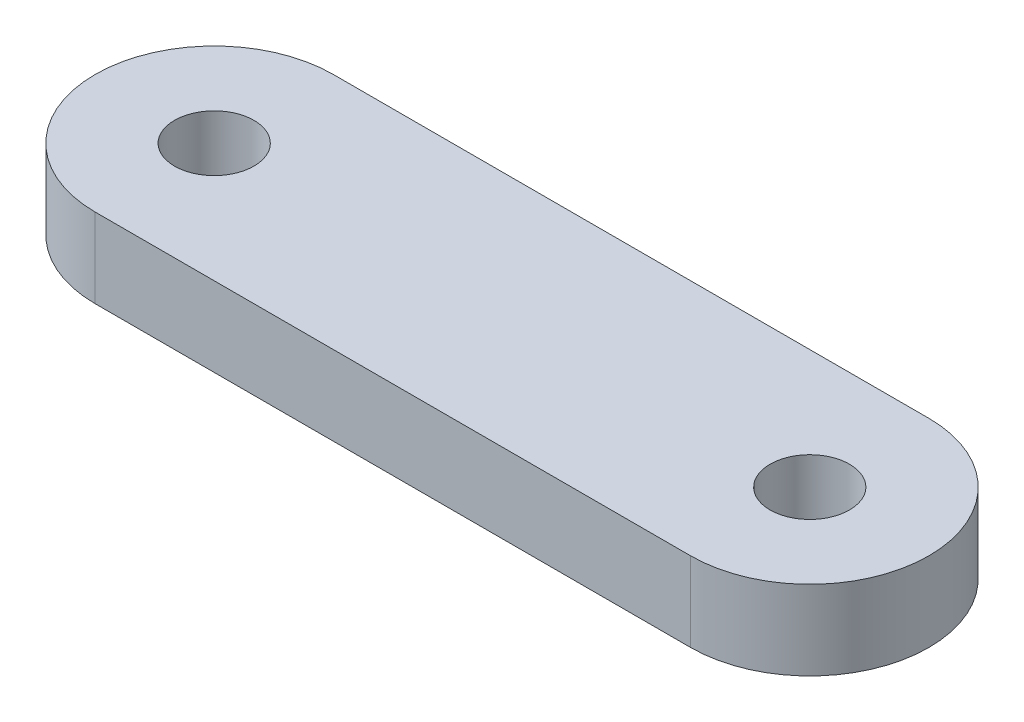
ISO-10303-21;
HEADER;
FILE_DESCRIPTION(('STEP AP214'),'2;1');
FILE_NAME('part.step','',(''),(''),'','','');
FILE_SCHEMA(('AUTOMOTIVE_DESIGN { 1 0 10303 214 1 1 1 1 }'));
ENDSEC;
DATA;
#1=APPLICATION_CONTEXT('core data for automotive mechanical design processes');
#2=APPLICATION_PROTOCOL_DEFINITION('international standard','automotive_design',2000,#1);
#3=PRODUCT_CONTEXT('',#1,'mechanical');
#4=PRODUCT('Part','Part','',(#3));
#5=PRODUCT_RELATED_PRODUCT_CATEGORY('part','',(#4));
#6=PRODUCT_DEFINITION_FORMATION('','',#4);
#7=PRODUCT_DEFINITION_CONTEXT('part definition',#1,'design');
#8=PRODUCT_DEFINITION('design','',#6,#7);
#9=PRODUCT_DEFINITION_SHAPE('','',#8);
#10=(LENGTH_UNIT() NAMED_UNIT(*) SI_UNIT(.MILLI.,.METRE.));
#11=(NAMED_UNIT(*) PLANE_ANGLE_UNIT() SI_UNIT($,.RADIAN.));
#12=(NAMED_UNIT(*) SI_UNIT($,.STERADIAN.) SOLID_ANGLE_UNIT());
#13=UNCERTAINTY_MEASURE_WITH_UNIT(LENGTH_MEASURE(1.E-05),#10,'distance_accuracy_value','');
#14=(GEOMETRIC_REPRESENTATION_CONTEXT(3) GLOBAL_UNCERTAINTY_ASSIGNED_CONTEXT((#13)) GLOBAL_UNIT_ASSIGNED_CONTEXT((#10,
#11,#12)) REPRESENTATION_CONTEXT('',''));
#15=CARTESIAN_POINT('',(0.,0.,0.));
#16=DIRECTION('',(0.,0.,1.));
#17=DIRECTION('',(1.,0.,0.));
#18=AXIS2_PLACEMENT_3D('',#15,#16,#17);
#19=CARTESIAN_POINT('',(-7.5,2.,0.));
#20=DIRECTION('',(0.,-1.,0.));
#21=DIRECTION('',(0.,0.,-1.));
#22=AXIS2_PLACEMENT_3D('',#19,#20,#21);
#23=PLANE('',#22);
#24=CARTESIAN_POINT('',(-7.5,2.,0.));
#25=DIRECTION('',(0.,1.,0.));
#26=DIRECTION('',(0.,0.,1.));
#27=AXIS2_PLACEMENT_3D('',#24,#25,#26);
#28=CIRCLE('',#27,1.);
#29=CARTESIAN_POINT('',(-7.5,2.,1.));
#30=VERTEX_POINT('',#29);
#31=EDGE_CURVE('E82',#30,#30,#28,.T.);
#32=ORIENTED_EDGE('',*,*,#31,.F.);
#33=EDGE_LOOP('',(#32));
#34=FACE_BOUND('',#33,.T.);
#35=CARTESIAN_POINT('',(-7.5,2.,0.));
#36=DIRECTION('',(0.,1.,0.));
#37=DIRECTION('',(0.,0.,-1.));
#38=AXIS2_PLACEMENT_3D('',#35,#36,#37);
#39=CIRCLE('',#38,3.);
#40=CARTESIAN_POINT('',(-7.5,2.,-3.));
#41=VERTEX_POINT('',#40);
#42=CARTESIAN_POINT('',(-7.5,2.,3.));
#43=VERTEX_POINT('',#42);
#44=EDGE_CURVE('E67',#41,#43,#39,.T.);
#45=ORIENTED_EDGE('',*,*,#44,.T.);
#46=DIRECTION('',(1.,0.,0.));
#47=VECTOR('',#46,1.);
#48=CARTESIAN_POINT('',(-7.5,2.,3.));
#49=LINE('',#48,#47);
#50=CARTESIAN_POINT('',(7.5,2.,3.));
#51=VERTEX_POINT('',#50);
#52=EDGE_CURVE('E62',#43,#51,#49,.T.);
#53=ORIENTED_EDGE('',*,*,#52,.T.);
#54=CARTESIAN_POINT('',(7.5,2.,0.));
#55=DIRECTION('',(0.,1.,0.));
#56=DIRECTION('',(0.,0.,1.));
#57=AXIS2_PLACEMENT_3D('',#54,#55,#56);
#58=CIRCLE('',#57,3.);
#59=CARTESIAN_POINT('',(7.5,2.,-3.));
#60=VERTEX_POINT('',#59);
#61=EDGE_CURVE('E65',#51,#60,#58,.T.);
#62=ORIENTED_EDGE('',*,*,#61,.T.);
#63=DIRECTION('',(-1.,0.,0.));
#64=VECTOR('',#63,1.);
#65=CARTESIAN_POINT('',(-7.5,2.,-3.));
#66=LINE('',#65,#64);
#67=EDGE_CURVE('E32',#60,#41,#66,.T.);
#68=ORIENTED_EDGE('',*,*,#67,.T.);
#69=EDGE_LOOP('',(#45,#53,#62,#68));
#70=FACE_BOUND('',#69,.T.);
#71=CARTESIAN_POINT('',(7.5,2.,0.));
#72=DIRECTION('',(0.,1.,0.));
#73=DIRECTION('',(0.,0.,1.));
#74=AXIS2_PLACEMENT_3D('',#71,#72,#73);
#75=CIRCLE('',#74,1.);
#76=CARTESIAN_POINT('',(7.5,2.,0.999999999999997));
#77=VERTEX_POINT('',#76);
#78=EDGE_CURVE('E97',#77,#77,#75,.T.);
#79=ORIENTED_EDGE('',*,*,#78,.F.);
#80=EDGE_LOOP('',(#79));
#81=FACE_BOUND('',#80,.T.);
#82=ADVANCED_FACE('F15',(#34,#70,#81),#23,.F.);
#83=CARTESIAN_POINT('',(-7.5,0.,0.));
#84=DIRECTION('',(0.,-1.,0.));
#85=DIRECTION('',(0.,0.,-1.));
#86=AXIS2_PLACEMENT_3D('',#83,#84,#85);
#87=PLANE('',#86);
#88=CARTESIAN_POINT('',(-7.5,0.,0.));
#89=DIRECTION('',(0.,1.,0.));
#90=DIRECTION('',(0.,0.,1.));
#91=AXIS2_PLACEMENT_3D('',#88,#89,#90);
#92=CIRCLE('',#91,1.);
#93=CARTESIAN_POINT('',(-7.5,0.,1.));
#94=VERTEX_POINT('',#93);
#95=EDGE_CURVE('E94',#94,#94,#92,.T.);
#96=ORIENTED_EDGE('',*,*,#95,.T.);
#97=EDGE_LOOP('',(#96));
#98=FACE_BOUND('',#97,.T.);
#99=CARTESIAN_POINT('',(-7.5,0.,0.));
#100=DIRECTION('',(0.,1.,0.));
#101=DIRECTION('',(0.,0.,-1.));
#102=AXIS2_PLACEMENT_3D('',#99,#100,#101);
#103=CIRCLE('',#102,3.);
#104=CARTESIAN_POINT('',(-7.5,0.,-3.));
#105=VERTEX_POINT('',#104);
#106=CARTESIAN_POINT('',(-7.5,0.,3.));
#107=VERTEX_POINT('',#106);
#108=EDGE_CURVE('E79',#105,#107,#103,.T.);
#109=ORIENTED_EDGE('',*,*,#108,.F.);
#110=DIRECTION('',(-1.,0.,0.));
#111=VECTOR('',#110,1.);
#112=CARTESIAN_POINT('',(-7.5,0.,-3.));
#113=LINE('',#112,#111);
#114=CARTESIAN_POINT('',(7.5,0.,-3.));
#115=VERTEX_POINT('',#114);
#116=EDGE_CURVE('E55',#115,#105,#113,.T.);
#117=ORIENTED_EDGE('',*,*,#116,.F.);
#118=CARTESIAN_POINT('',(7.5,0.,0.));
#119=DIRECTION('',(0.,1.,0.));
#120=DIRECTION('',(0.,0.,1.));
#121=AXIS2_PLACEMENT_3D('',#118,#119,#120);
#122=CIRCLE('',#121,3.);
#123=CARTESIAN_POINT('',(7.5,0.,3.));
#124=VERTEX_POINT('',#123);
#125=EDGE_CURVE('E49',#124,#115,#122,.T.);
#126=ORIENTED_EDGE('',*,*,#125,.F.);
#127=DIRECTION('',(1.,0.,0.));
#128=VECTOR('',#127,1.);
#129=CARTESIAN_POINT('',(-7.5,0.,3.));
#130=LINE('',#129,#128);
#131=EDGE_CURVE('E71',#107,#124,#130,.T.);
#132=ORIENTED_EDGE('',*,*,#131,.F.);
#133=EDGE_LOOP('',(#109,#117,#126,#132));
#134=FACE_BOUND('',#133,.T.);
#135=CARTESIAN_POINT('',(7.5,0.,0.));
#136=DIRECTION('',(0.,1.,0.));
#137=DIRECTION('',(0.,0.,1.));
#138=AXIS2_PLACEMENT_3D('',#135,#136,#137);
#139=CIRCLE('',#138,1.);
#140=CARTESIAN_POINT('',(7.5,0.,0.999999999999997));
#141=VERTEX_POINT('',#140);
#142=EDGE_CURVE('E100',#141,#141,#139,.T.);
#143=ORIENTED_EDGE('',*,*,#142,.T.);
#144=EDGE_LOOP('',(#143));
#145=FACE_BOUND('',#144,.T.);
#146=ADVANCED_FACE('F90',(#98,#134,#145),#87,.T.);
#147=CARTESIAN_POINT('',(-7.5,2.,0.));
#148=DIRECTION('',(0.,-1.,0.));
#149=DIRECTION('',(0.,0.,-1.));
#150=AXIS2_PLACEMENT_3D('',#147,#148,#149);
#151=CYLINDRICAL_SURFACE('',#150,3.);
#152=ORIENTED_EDGE('',*,*,#108,.T.);
#153=DIRECTION('',(0.,-1.,0.));
#154=VECTOR('',#153,1.);
#155=CARTESIAN_POINT('',(-7.5,2.,3.));
#156=LINE('',#155,#154);
#157=EDGE_CURVE('E9',#43,#107,#156,.T.);
#158=ORIENTED_EDGE('',*,*,#157,.F.);
#159=ORIENTED_EDGE('',*,*,#44,.F.);
#160=DIRECTION('',(0.,-1.,0.));
#161=VECTOR('',#160,1.);
#162=CARTESIAN_POINT('',(-7.5,2.,-3.));
#163=LINE('',#162,#161);
#164=EDGE_CURVE('E75',#41,#105,#163,.T.);
#165=ORIENTED_EDGE('',*,*,#164,.T.);
#166=EDGE_LOOP('',(#152,#158,#159,#165));
#167=FACE_BOUND('',#166,.T.);
#168=ADVANCED_FACE('F17',(#167),#151,.T.);
#169=CARTESIAN_POINT('',(-7.5,2.,3.));
#170=DIRECTION('',(0.,0.,-1.));
#171=DIRECTION('',(-1.,0.,0.));
#172=AXIS2_PLACEMENT_3D('',#169,#170,#171);
#173=PLANE('',#172);
#174=ORIENTED_EDGE('',*,*,#131,.T.);
#175=DIRECTION('',(0.,-1.,0.));
#176=VECTOR('',#175,1.);
#177=CARTESIAN_POINT('',(7.5,2.,3.));
#178=LINE('',#177,#176);
#179=EDGE_CURVE('E24',#51,#124,#178,.T.);
#180=ORIENTED_EDGE('',*,*,#179,.F.);
#181=ORIENTED_EDGE('',*,*,#52,.F.);
#182=ORIENTED_EDGE('',*,*,#157,.T.);
#183=EDGE_LOOP('',(#174,#180,#181,#182));
#184=FACE_BOUND('',#183,.T.);
#185=ADVANCED_FACE('F70',(#184),#173,.F.);
#186=CARTESIAN_POINT('',(7.5,2.,0.));
#187=DIRECTION('',(0.,-1.,0.));
#188=DIRECTION('',(0.,0.,-1.));
#189=AXIS2_PLACEMENT_3D('',#186,#187,#188);
#190=CYLINDRICAL_SURFACE('',#189,3.);
#191=ORIENTED_EDGE('',*,*,#125,.T.);
#192=DIRECTION('',(0.,-1.,0.));
#193=VECTOR('',#192,1.);
#194=CARTESIAN_POINT('',(7.5,2.,-3.));
#195=LINE('',#194,#193);
#196=EDGE_CURVE('E72',#60,#115,#195,.T.);
#197=ORIENTED_EDGE('',*,*,#196,.F.);
#198=ORIENTED_EDGE('',*,*,#61,.F.);
#199=ORIENTED_EDGE('',*,*,#179,.T.);
#200=EDGE_LOOP('',(#191,#197,#198,#199));
#201=FACE_BOUND('',#200,.T.);
#202=ADVANCED_FACE('F73',(#201),#190,.T.);
#203=CARTESIAN_POINT('',(-7.5,2.,-3.));
#204=DIRECTION('',(0.,0.,1.));
#205=DIRECTION('',(1.,0.,0.));
#206=AXIS2_PLACEMENT_3D('',#203,#204,#205);
#207=PLANE('',#206);
#208=ORIENTED_EDGE('',*,*,#116,.T.);
#209=ORIENTED_EDGE('',*,*,#164,.F.);
#210=ORIENTED_EDGE('',*,*,#67,.F.);
#211=ORIENTED_EDGE('',*,*,#196,.T.);
#212=EDGE_LOOP('',(#208,#209,#210,#211));
#213=FACE_BOUND('',#212,.T.);
#214=ADVANCED_FACE('F87',(#213),#207,.F.);
#215=CARTESIAN_POINT('',(-7.5,2.,0.));
#216=DIRECTION('',(0.,-1.,0.));
#217=DIRECTION('',(0.,0.,-1.));
#218=AXIS2_PLACEMENT_3D('',#215,#216,#217);
#219=CYLINDRICAL_SURFACE('',#218,1.);
#220=ORIENTED_EDGE('',*,*,#31,.T.);
#221=EDGE_LOOP('',(#220));
#222=FACE_BOUND('',#221,.T.);
#223=ORIENTED_EDGE('',*,*,#95,.F.);
#224=EDGE_LOOP('',(#223));
#225=FACE_BOUND('',#224,.T.);
#226=ADVANCED_FACE('F120',(#222,#225),#219,.F.);
#227=CARTESIAN_POINT('',(7.5,2.,0.));
#228=DIRECTION('',(0.,-1.,0.));
#229=DIRECTION('',(0.,0.,-1.));
#230=AXIS2_PLACEMENT_3D('',#227,#228,#229);
#231=CYLINDRICAL_SURFACE('',#230,1.);
#232=ORIENTED_EDGE('',*,*,#78,.T.);
#233=EDGE_LOOP('',(#232));
#234=FACE_BOUND('',#233,.T.);
#235=ORIENTED_EDGE('',*,*,#142,.F.);
#236=EDGE_LOOP('',(#235));
#237=FACE_BOUND('',#236,.T.);
#238=ADVANCED_FACE('F106',(#234,#237),#231,.F.);
#239=CLOSED_SHELL('',(#82,#146,#168,#185,#202,#214,#226,#238));
#240=MANIFOLD_SOLID_BREP('B1',#239);
#241=ADVANCED_BREP_SHAPE_REPRESENTATION('',(#18,#240),#14);
#242=SHAPE_DEFINITION_REPRESENTATION(#9,#241);
ENDSEC;
END-ISO-10303-21;
